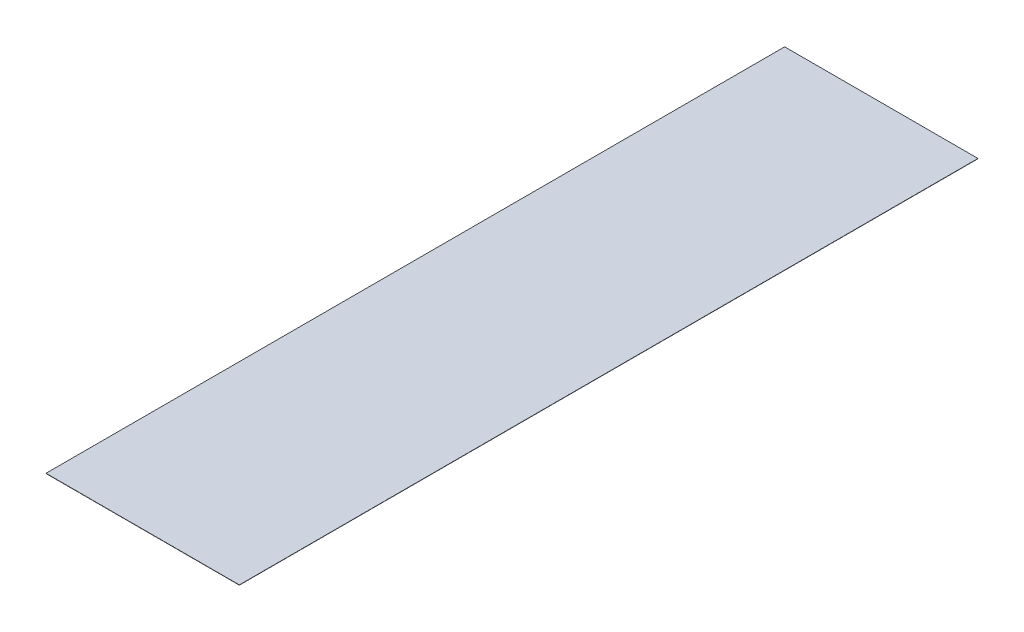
ISO-10303-21;
HEADER;
FILE_DESCRIPTION(('STEP AP214'),'2;1');
FILE_NAME('part.step','',(''),(''),'','','');
FILE_SCHEMA(('AUTOMOTIVE_DESIGN { 1 0 10303 214 1 1 1 1 }'));
ENDSEC;
DATA;
#1=APPLICATION_CONTEXT('core data for automotive mechanical design processes');
#2=APPLICATION_PROTOCOL_DEFINITION('international standard','automotive_design',2000,#1);
#3=PRODUCT_CONTEXT('',#1,'mechanical');
#4=PRODUCT('Part','Part','',(#3));
#5=PRODUCT_RELATED_PRODUCT_CATEGORY('part','',(#4));
#6=PRODUCT_DEFINITION_FORMATION('','',#4);
#7=PRODUCT_DEFINITION_CONTEXT('part definition',#1,'design');
#8=PRODUCT_DEFINITION('design','',#6,#7);
#9=PRODUCT_DEFINITION_SHAPE('','',#8);
#10=(LENGTH_UNIT() NAMED_UNIT(*) SI_UNIT(.MILLI.,.METRE.));
#11=(NAMED_UNIT(*) PLANE_ANGLE_UNIT() SI_UNIT($,.RADIAN.));
#12=(NAMED_UNIT(*) SI_UNIT($,.STERADIAN.) SOLID_ANGLE_UNIT());
#13=UNCERTAINTY_MEASURE_WITH_UNIT(LENGTH_MEASURE(1.E-05),#10,'distance_accuracy_value','');
#14=(GEOMETRIC_REPRESENTATION_CONTEXT(3) GLOBAL_UNCERTAINTY_ASSIGNED_CONTEXT((#13)) GLOBAL_UNIT_ASSIGNED_CONTEXT((#10,
#11,#12)) REPRESENTATION_CONTEXT('',''));
#15=CARTESIAN_POINT('',(0.,0.,0.));
#16=DIRECTION('',(0.,0.,1.));
#17=DIRECTION('',(1.,0.,0.));
#18=AXIS2_PLACEMENT_3D('',#15,#16,#17);
#19=CARTESIAN_POINT('',(-19.7731932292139,0.0079,12.1285));
#20=DIRECTION('',(0.,0.,-1.));
#21=DIRECTION('',(-1.,0.,0.));
#22=AXIS2_PLACEMENT_3D('',#19,#20,#21);
#23=PLANE('',#22);
#24=DIRECTION('',(1.,0.,0.));
#25=VECTOR('',#24,1.);
#26=CARTESIAN_POINT('',(-19.7731932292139,0.,12.1285));
#27=LINE('',#26,#25);
#28=CARTESIAN_POINT('',(-3.30348107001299,0.,12.1285));
#29=VERTEX_POINT('',#28);
#30=CARTESIAN_POINT('',(3.04651892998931,0.,12.1285));
#31=VERTEX_POINT('',#30);
#32=EDGE_CURVE('E93',#29,#31,#27,.T.);
#33=ORIENTED_EDGE('',*,*,#32,.T.);
#34=DIRECTION('',(0.,-1.,0.));
#35=VECTOR('',#34,1.);
#36=CARTESIAN_POINT('',(3.04651892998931,0.0079,12.1285));
#37=LINE('',#36,#35);
#38=CARTESIAN_POINT('',(3.04651892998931,0.0079,12.1285));
#39=VERTEX_POINT('',#38);
#40=EDGE_CURVE('E11',#39,#31,#37,.T.);
#41=ORIENTED_EDGE('',*,*,#40,.F.);
#42=DIRECTION('',(1.,0.,0.));
#43=VECTOR('',#42,1.);
#44=CARTESIAN_POINT('',(-19.7731932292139,0.0079,12.1285));
#45=LINE('',#44,#43);
#46=CARTESIAN_POINT('',(-3.30348107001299,0.0079,12.1285));
#47=VERTEX_POINT('',#46);
#48=EDGE_CURVE('E79',#47,#39,#45,.T.);
#49=ORIENTED_EDGE('',*,*,#48,.F.);
#50=DIRECTION('',(0.,-1.,0.));
#51=VECTOR('',#50,1.);
#52=CARTESIAN_POINT('',(-3.30348107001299,0.0079,12.1285));
#53=LINE('',#52,#51);
#54=EDGE_CURVE('E46',#47,#29,#53,.T.);
#55=ORIENTED_EDGE('',*,*,#54,.T.);
#56=EDGE_LOOP('',(#33,#41,#49,#55));
#57=FACE_BOUND('',#56,.T.);
#58=ADVANCED_FACE('F30',(#57),#23,.F.);
#59=CARTESIAN_POINT('',(3.04651892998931,0.0079,1.1179340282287E-13));
#60=DIRECTION('',(-1.,0.,0.));
#61=DIRECTION('',(0.,0.,1.));
#62=AXIS2_PLACEMENT_3D('',#59,#60,#61);
#63=PLANE('',#62);
#64=DIRECTION('',(0.,0.,-1.));
#65=VECTOR('',#64,1.);
#66=CARTESIAN_POINT('',(3.04651892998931,0.,1.1179340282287E-13));
#67=LINE('',#66,#65);
#68=CARTESIAN_POINT('',(3.04651892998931,0.,-12.1284999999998));
#69=VERTEX_POINT('',#68);
#70=EDGE_CURVE('E84',#31,#69,#67,.T.);
#71=ORIENTED_EDGE('',*,*,#70,.T.);
#72=DIRECTION('',(0.,-1.,0.));
#73=VECTOR('',#72,1.);
#74=CARTESIAN_POINT('',(3.04651892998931,0.0079,-12.1284999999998));
#75=LINE('',#74,#73);
#76=CARTESIAN_POINT('',(3.04651892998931,0.0079,-12.1284999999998));
#77=VERTEX_POINT('',#76);
#78=EDGE_CURVE('E38',#77,#69,#75,.T.);
#79=ORIENTED_EDGE('',*,*,#78,.F.);
#80=DIRECTION('',(0.,0.,-1.));
#81=VECTOR('',#80,1.);
#82=CARTESIAN_POINT('',(3.04651892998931,0.0079,1.1179340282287E-13));
#83=LINE('',#82,#81);
#84=EDGE_CURVE('E71',#39,#77,#83,.T.);
#85=ORIENTED_EDGE('',*,*,#84,.F.);
#86=ORIENTED_EDGE('',*,*,#40,.T.);
#87=EDGE_LOOP('',(#71,#79,#85,#86));
#88=FACE_BOUND('',#87,.T.);
#89=ADVANCED_FACE('F83',(#88),#63,.F.);
#90=CARTESIAN_POINT('',(-19.7731932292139,0.0079,-12.1284999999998));
#91=DIRECTION('',(0.,0.,-1.));
#92=DIRECTION('',(-1.,0.,0.));
#93=AXIS2_PLACEMENT_3D('',#90,#91,#92);
#94=PLANE('',#93);
#95=DIRECTION('',(1.,0.,0.));
#96=VECTOR('',#95,1.);
#97=CARTESIAN_POINT('',(-19.7731932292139,0.,-12.1284999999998));
#98=LINE('',#97,#96);
#99=CARTESIAN_POINT('',(-3.30348107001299,0.,-12.1284999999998));
#100=VERTEX_POINT('',#99);
#101=EDGE_CURVE('E96',#100,#69,#98,.T.);
#102=ORIENTED_EDGE('',*,*,#101,.F.);
#103=DIRECTION('',(0.,-1.,0.));
#104=VECTOR('',#103,1.);
#105=CARTESIAN_POINT('',(-3.30348107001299,0.0079,-12.1284999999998));
#106=LINE('',#105,#104);
#107=CARTESIAN_POINT('',(-3.30348107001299,0.0079,-12.1284999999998));
#108=VERTEX_POINT('',#107);
#109=EDGE_CURVE('E60',#108,#100,#106,.T.);
#110=ORIENTED_EDGE('',*,*,#109,.F.);
#111=DIRECTION('',(1.,0.,0.));
#112=VECTOR('',#111,1.);
#113=CARTESIAN_POINT('',(-19.7731932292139,0.0079,-12.1284999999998));
#114=LINE('',#113,#112);
#115=EDGE_CURVE('E78',#108,#77,#114,.T.);
#116=ORIENTED_EDGE('',*,*,#115,.T.);
#117=ORIENTED_EDGE('',*,*,#78,.T.);
#118=EDGE_LOOP('',(#102,#110,#116,#117));
#119=FACE_BOUND('',#118,.T.);
#120=ADVANCED_FACE('F87',(#119),#94,.T.);
#121=CARTESIAN_POINT('',(-3.30348107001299,0.0079,1.1179340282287E-13));
#122=DIRECTION('',(-1.,0.,0.));
#123=DIRECTION('',(0.,0.,1.));
#124=AXIS2_PLACEMENT_3D('',#121,#122,#123);
#125=PLANE('',#124);
#126=DIRECTION('',(0.,0.,-1.));
#127=VECTOR('',#126,1.);
#128=CARTESIAN_POINT('',(-3.30348107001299,0.,1.1179340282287E-13));
#129=LINE('',#128,#127);
#130=EDGE_CURVE('E98',#29,#100,#129,.T.);
#131=ORIENTED_EDGE('',*,*,#130,.F.);
#132=ORIENTED_EDGE('',*,*,#54,.F.);
#133=DIRECTION('',(0.,0.,-1.));
#134=VECTOR('',#133,1.);
#135=CARTESIAN_POINT('',(-3.30348107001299,0.0079,1.1179340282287E-13));
#136=LINE('',#135,#134);
#137=EDGE_CURVE('E88',#47,#108,#136,.T.);
#138=ORIENTED_EDGE('',*,*,#137,.T.);
#139=ORIENTED_EDGE('',*,*,#109,.T.);
#140=EDGE_LOOP('',(#131,#132,#138,#139));
#141=FACE_BOUND('',#140,.T.);
#142=ADVANCED_FACE('F104',(#141),#125,.T.);
#143=CARTESIAN_POINT('',(-19.7731932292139,0.0079,1.1179340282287E-13));
#144=DIRECTION('',(0.,1.,0.));
#145=DIRECTION('',(0.,0.,1.));
#146=AXIS2_PLACEMENT_3D('',#143,#144,#145);
#147=PLANE('',#146);
#148=ORIENTED_EDGE('',*,*,#48,.T.);
#149=ORIENTED_EDGE('',*,*,#84,.T.);
#150=ORIENTED_EDGE('',*,*,#115,.F.);
#151=ORIENTED_EDGE('',*,*,#137,.F.);
#152=EDGE_LOOP('',(#148,#149,#150,#151));
#153=FACE_BOUND('',#152,.T.);
#154=ADVANCED_FACE('F75',(#153),#147,.T.);
#155=CARTESIAN_POINT('',(-19.7731932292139,0.,1.1179340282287E-13));
#156=DIRECTION('',(0.,1.,0.));
#157=DIRECTION('',(0.,0.,1.));
#158=AXIS2_PLACEMENT_3D('',#155,#156,#157);
#159=PLANE('',#158);
#160=ORIENTED_EDGE('',*,*,#32,.F.);
#161=ORIENTED_EDGE('',*,*,#130,.T.);
#162=ORIENTED_EDGE('',*,*,#101,.T.);
#163=ORIENTED_EDGE('',*,*,#70,.F.);
#164=EDGE_LOOP('',(#160,#161,#162,#163));
#165=FACE_BOUND('',#164,.T.);
#166=ADVANCED_FACE('F103',(#165),#159,.F.);
#167=CLOSED_SHELL('',(#58,#89,#120,#142,#154,#166));
#168=MANIFOLD_SOLID_BREP('B2',#167);
#169=ADVANCED_BREP_SHAPE_REPRESENTATION('',(#18,#168),#14);
#170=SHAPE_DEFINITION_REPRESENTATION(#9,#169);
ENDSEC;
END-ISO-10303-21;
